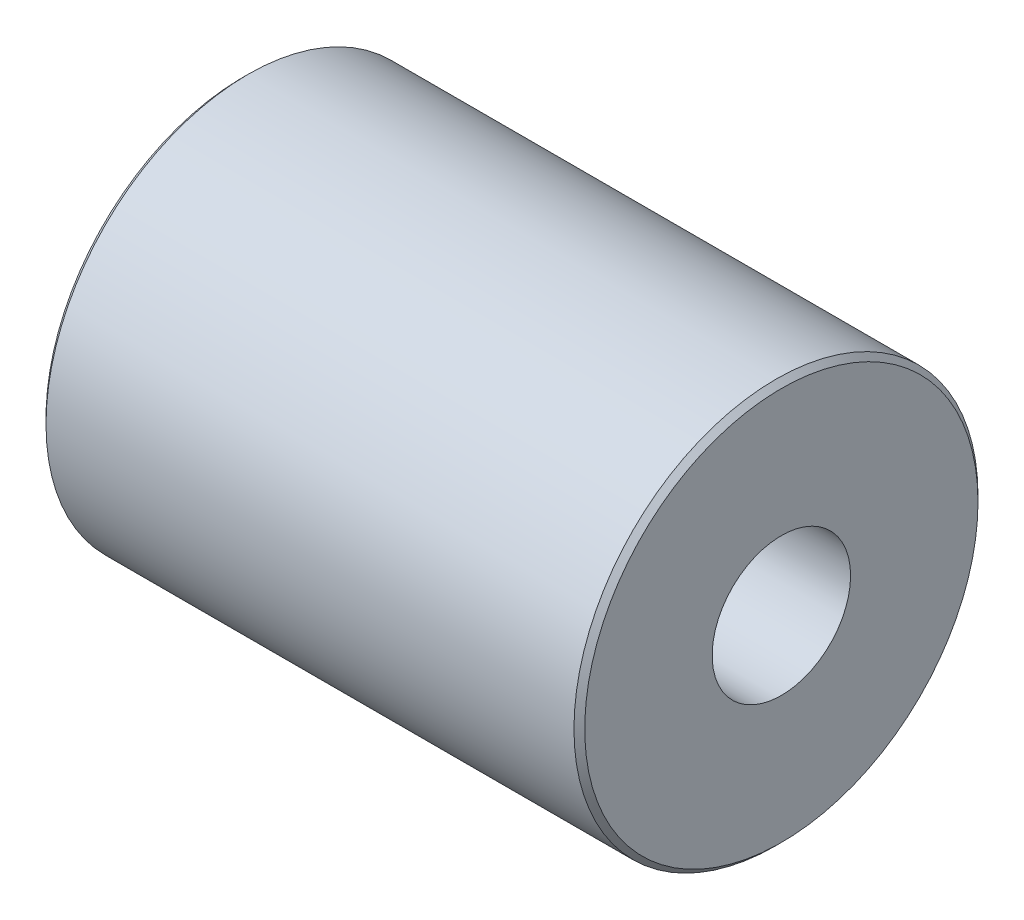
ISO-10303-21;
HEADER;
FILE_DESCRIPTION(('STEP AP214'),'2;1');
FILE_NAME('part.step','',(''),(''),'','','');
FILE_SCHEMA(('AUTOMOTIVE_DESIGN { 1 0 10303 214 1 1 1 1 }'));
ENDSEC;
DATA;
#1=APPLICATION_CONTEXT('core data for automotive mechanical design processes');
#2=APPLICATION_PROTOCOL_DEFINITION('international standard','automotive_design',2000,#1);
#3=PRODUCT_CONTEXT('',#1,'mechanical');
#4=PRODUCT('Part','Part','',(#3));
#5=PRODUCT_RELATED_PRODUCT_CATEGORY('part','',(#4));
#6=PRODUCT_DEFINITION_FORMATION('','',#4);
#7=PRODUCT_DEFINITION_CONTEXT('part definition',#1,'design');
#8=PRODUCT_DEFINITION('design','',#6,#7);
#9=PRODUCT_DEFINITION_SHAPE('','',#8);
#10=(LENGTH_UNIT() NAMED_UNIT(*) SI_UNIT(.MILLI.,.METRE.));
#11=(NAMED_UNIT(*) PLANE_ANGLE_UNIT() SI_UNIT($,.RADIAN.));
#12=(NAMED_UNIT(*) SI_UNIT($,.STERADIAN.) SOLID_ANGLE_UNIT());
#13=UNCERTAINTY_MEASURE_WITH_UNIT(LENGTH_MEASURE(1.E-05),#10,'distance_accuracy_value','');
#14=(GEOMETRIC_REPRESENTATION_CONTEXT(3) GLOBAL_UNCERTAINTY_ASSIGNED_CONTEXT((#13)) GLOBAL_UNIT_ASSIGNED_CONTEXT((#10,
#11,#12)) REPRESENTATION_CONTEXT('',''));
#15=CARTESIAN_POINT('',(0.,0.,0.));
#16=DIRECTION('',(0.,0.,1.));
#17=DIRECTION('',(1.,0.,0.));
#18=AXIS2_PLACEMENT_3D('',#15,#16,#17);
#19=CARTESIAN_POINT('',(12.7,0.,0.));
#20=DIRECTION('',(-1.,0.,0.));
#21=DIRECTION('',(0.,0.,1.));
#22=AXIS2_PLACEMENT_3D('',#19,#20,#21);
#23=CYLINDRICAL_SURFACE('',#22,9.525);
#24=CARTESIAN_POINT('',(12.446,0.,0.));
#25=DIRECTION('',(1.,0.,0.));
#26=DIRECTION('',(0.,0.,-1.));
#27=AXIS2_PLACEMENT_3D('',#24,#25,#26);
#28=CIRCLE('',#27,9.525);
#29=CARTESIAN_POINT('',(12.446,0.,-9.525));
#30=VERTEX_POINT('',#29);
#31=EDGE_CURVE('E38',#30,#30,#28,.F.);
#32=ORIENTED_EDGE('',*,*,#31,.T.);
#33=EDGE_LOOP('',(#32));
#34=FACE_BOUND('',#33,.T.);
#35=CARTESIAN_POINT('',(-12.446,0.,0.));
#36=DIRECTION('',(1.,0.,0.));
#37=DIRECTION('',(0.,0.,-1.));
#38=AXIS2_PLACEMENT_3D('',#35,#36,#37);
#39=CIRCLE('',#38,9.525);
#40=CARTESIAN_POINT('',(-12.446,0.,-9.525));
#41=VERTEX_POINT('',#40);
#42=EDGE_CURVE('E42',#41,#41,#39,.T.);
#43=ORIENTED_EDGE('',*,*,#42,.T.);
#44=EDGE_LOOP('',(#43));
#45=FACE_BOUND('',#44,.T.);
#46=ADVANCED_FACE('F31',(#34,#45),#23,.T.);
#47=CARTESIAN_POINT('',(12.7,0.,0.));
#48=DIRECTION('',(1.,0.,0.));
#49=DIRECTION('',(0.,0.,-1.));
#50=AXIS2_PLACEMENT_3D('',#47,#48,#49);
#51=PLANE('',#50);
#52=CARTESIAN_POINT('',(12.7,0.,0.));
#53=DIRECTION('',(1.,0.,0.));
#54=DIRECTION('',(0.,0.,-1.));
#55=AXIS2_PLACEMENT_3D('',#52,#53,#54);
#56=CIRCLE('',#55,9.271);
#57=CARTESIAN_POINT('',(12.7,0.,-9.271));
#58=VERTEX_POINT('',#57);
#59=EDGE_CURVE('E46',#58,#58,#56,.T.);
#60=ORIENTED_EDGE('',*,*,#59,.T.);
#61=EDGE_LOOP('',(#60));
#62=FACE_BOUND('',#61,.T.);
#63=CARTESIAN_POINT('',(12.7,0.,0.));
#64=DIRECTION('',(1.,0.,0.));
#65=DIRECTION('',(0.,0.,-1.));
#66=AXIS2_PLACEMENT_3D('',#63,#64,#65);
#67=CIRCLE('',#66,3.26389999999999);
#68=CARTESIAN_POINT('',(12.7,0.,-3.26389999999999));
#69=VERTEX_POINT('',#68);
#70=EDGE_CURVE('E54',#69,#69,#67,.T.);
#71=ORIENTED_EDGE('',*,*,#70,.F.);
#72=EDGE_LOOP('',(#71));
#73=FACE_BOUND('',#72,.T.);
#74=ADVANCED_FACE('F60',(#62,#73),#51,.T.);
#75=CARTESIAN_POINT('',(-12.7,0.,0.));
#76=DIRECTION('',(1.,0.,0.));
#77=DIRECTION('',(0.,0.,-1.));
#78=AXIS2_PLACEMENT_3D('',#75,#76,#77);
#79=PLANE('',#78);
#80=CARTESIAN_POINT('',(-12.7,0.,0.));
#81=DIRECTION('',(1.,0.,0.));
#82=DIRECTION('',(0.,0.,-1.));
#83=AXIS2_PLACEMENT_3D('',#80,#81,#82);
#84=CIRCLE('',#83,9.271);
#85=CARTESIAN_POINT('',(-12.7,0.,-9.271));
#86=VERTEX_POINT('',#85);
#87=EDGE_CURVE('E10',#86,#86,#84,.F.);
#88=ORIENTED_EDGE('',*,*,#87,.T.);
#89=EDGE_LOOP('',(#88));
#90=FACE_BOUND('',#89,.T.);
#91=CARTESIAN_POINT('',(-12.7,0.,0.));
#92=DIRECTION('',(1.,0.,0.));
#93=DIRECTION('',(0.,0.,-1.));
#94=AXIS2_PLACEMENT_3D('',#91,#92,#93);
#95=CIRCLE('',#94,3.26389999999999);
#96=CARTESIAN_POINT('',(-12.7,0.,-3.26389999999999));
#97=VERTEX_POINT('',#96);
#98=EDGE_CURVE('E51',#97,#97,#95,.T.);
#99=ORIENTED_EDGE('',*,*,#98,.T.);
#100=EDGE_LOOP('',(#99));
#101=FACE_BOUND('',#100,.T.);
#102=ADVANCED_FACE('F62',(#90,#101),#79,.F.);
#103=CARTESIAN_POINT('',(12.7,0.,0.));
#104=DIRECTION('',(1.,0.,0.));
#105=DIRECTION('',(0.,0.,-1.));
#106=AXIS2_PLACEMENT_3D('',#103,#104,#105);
#107=CYLINDRICAL_SURFACE('',#106,3.26389999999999);
#108=ORIENTED_EDGE('',*,*,#98,.F.);
#109=EDGE_LOOP('',(#108));
#110=FACE_BOUND('',#109,.T.);
#111=ORIENTED_EDGE('',*,*,#70,.T.);
#112=EDGE_LOOP('',(#111));
#113=FACE_BOUND('',#112,.T.);
#114=ADVANCED_FACE('F58',(#110,#113),#107,.F.);
#115=CARTESIAN_POINT('',(12.7,0.,0.));
#116=DIRECTION('',(-1.,0.,0.));
#117=DIRECTION('',(0.,0.,1.));
#118=AXIS2_PLACEMENT_3D('',#115,#116,#117);
#119=CONICAL_SURFACE('',#118,9.271,0.785398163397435);
#120=ORIENTED_EDGE('',*,*,#31,.F.);
#121=EDGE_LOOP('',(#120));
#122=FACE_BOUND('',#121,.T.);
#123=ORIENTED_EDGE('',*,*,#59,.F.);
#124=EDGE_LOOP('',(#123));
#125=FACE_BOUND('',#124,.T.);
#126=ADVANCED_FACE('F72',(#122,#125),#119,.T.);
#127=CARTESIAN_POINT('',(-12.446,0.,0.));
#128=DIRECTION('',(1.,0.,0.));
#129=DIRECTION('',(0.,0.,-1.));
#130=AXIS2_PLACEMENT_3D('',#127,#128,#129);
#131=CONICAL_SURFACE('',#130,9.525,0.785398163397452);
#132=ORIENTED_EDGE('',*,*,#87,.F.);
#133=EDGE_LOOP('',(#132));
#134=FACE_BOUND('',#133,.T.);
#135=ORIENTED_EDGE('',*,*,#42,.F.);
#136=EDGE_LOOP('',(#135));
#137=FACE_BOUND('',#136,.T.);
#138=ADVANCED_FACE('F33',(#134,#137),#131,.T.);
#139=CLOSED_SHELL('',(#46,#74,#102,#114,#126,#138));
#140=MANIFOLD_SOLID_BREP('B2',#139);
#141=ADVANCED_BREP_SHAPE_REPRESENTATION('',(#18,#140),#14);
#142=SHAPE_DEFINITION_REPRESENTATION(#9,#141);
ENDSEC;
END-ISO-10303-21;
